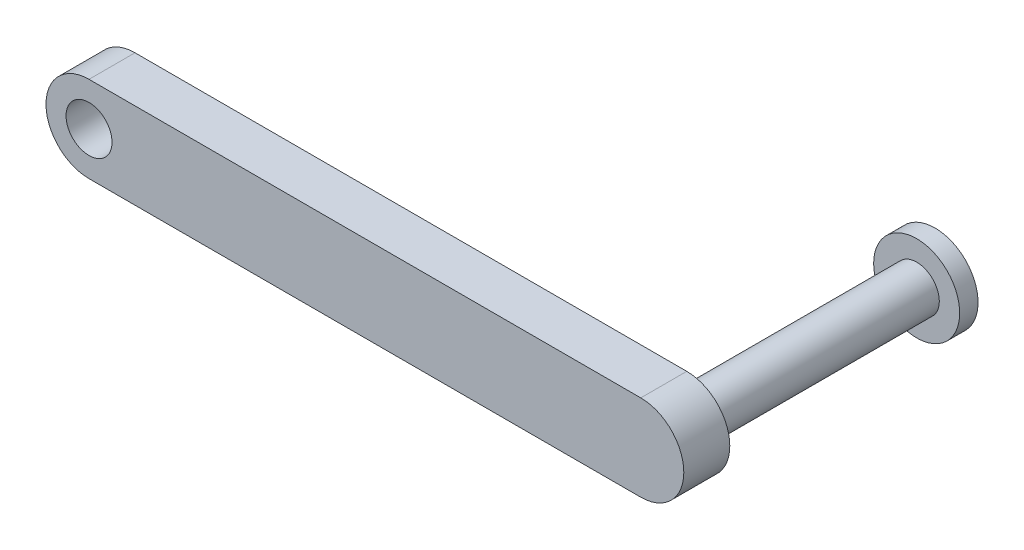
from build123d import *

# Parameters (mm, degrees)
SKETCH1_R           = 3.175
SKETCH1_R_2         = 3.127862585
BOSS_EXTRUDE1_DEPTH = 6.35
BOSS_EXTRUDE2_START = -38.1
SKETCH2_R           = 3.127862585
BOSS_EXTRUDE2_DEPTH = 38.1
BOSS_EXTRUDE3_START = 2.54
SKETCH3_R           = 5.941256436
BOSS_EXTRUDE3_DEPTH = 2.54


with BuildPart() as part:
    # Sketch1 → Boss-Extrude1 (new body)
    with BuildSketch(Plane.XY):
        with BuildLine():
            Line((-23.928546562, 5.941256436), (52.271453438, 5.941256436))
            ThreePointArc((52.271453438, 5.941256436), (58.212709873, 0), (52.271453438, -5.941256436))
            Line((52.271453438, -5.941256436), (-23.928546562, -5.941256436))
            ThreePointArc((-23.928546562, -5.941256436), (-29.869802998, 0), (-23.928546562, 5.941256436))
        make_face()
        with Locations((-23.928546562, 0)):
            Circle(SKETCH1_R, mode=Mode.SUBTRACT)
        with Locations((52.271453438, 0)):
            Circle(SKETCH1_R_2, mode=Mode.SUBTRACT)
    extrude(amount=BOSS_EXTRUDE1_DEPTH)

    # Sketch2 → Boss-Extrude2 (add)
    with BuildSketch(Plane.XY.offset(6.35).offset(BOSS_EXTRUDE2_START)):
        with Locations((52.271453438, 0)):
            Circle(SKETCH2_R)
    extrude(amount=BOSS_EXTRUDE2_DEPTH)

    # Sketch3 → Boss-Extrude3 (add)
    with BuildSketch(Plane(origin=(0, 0, -31.75), x_dir=(-1, 0, 0), z_dir=(0, 0, -1)).offset(BOSS_EXTRUDE3_START)):
        with Locations((-52.271453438, 0)):
            Circle(SKETCH3_R)
    extrude(amount=-BOSS_EXTRUDE3_DEPTH)


solid = part.part
